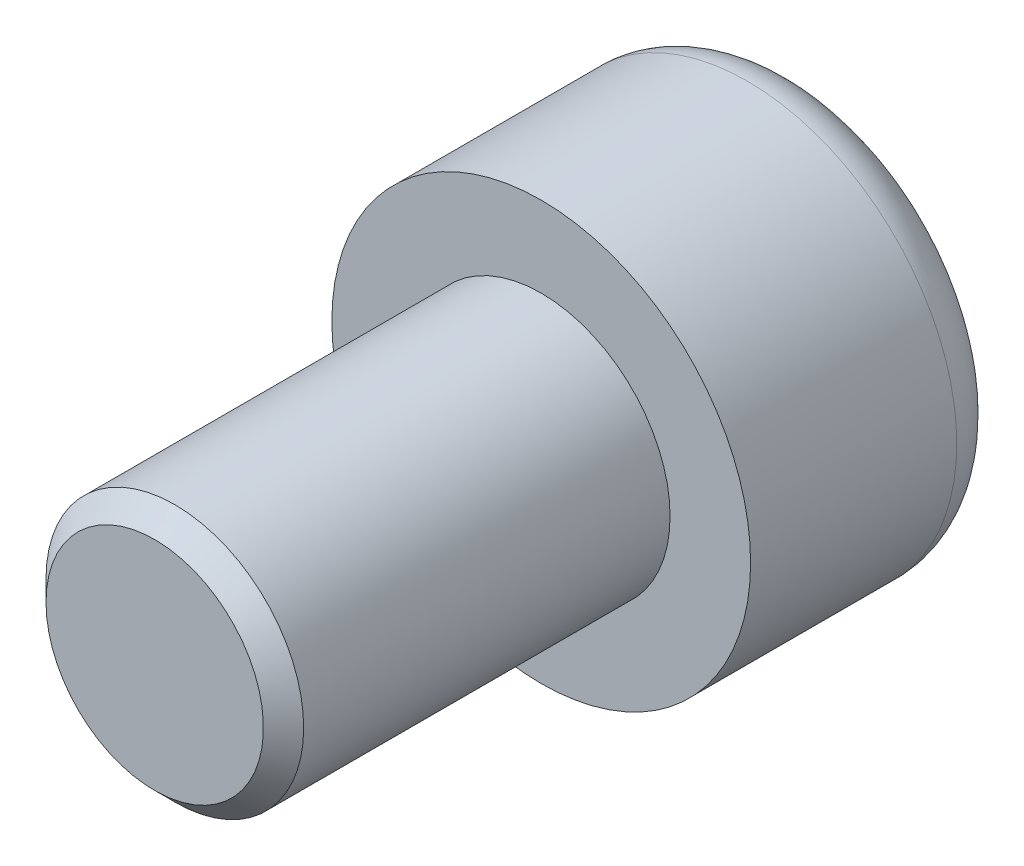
ISO-10303-21;
HEADER;
FILE_DESCRIPTION(('STEP AP214'),'2;1');
FILE_NAME('part.step','',(''),(''),'','','');
FILE_SCHEMA(('AUTOMOTIVE_DESIGN { 1 0 10303 214 1 1 1 1 }'));
ENDSEC;
DATA;
#1=APPLICATION_CONTEXT('core data for automotive mechanical design processes');
#2=APPLICATION_PROTOCOL_DEFINITION('international standard','automotive_design',2000,#1);
#3=PRODUCT_CONTEXT('',#1,'mechanical');
#4=PRODUCT('Part','Part','',(#3));
#5=PRODUCT_RELATED_PRODUCT_CATEGORY('part','',(#4));
#6=PRODUCT_DEFINITION_FORMATION('','',#4);
#7=PRODUCT_DEFINITION_CONTEXT('part definition',#1,'design');
#8=PRODUCT_DEFINITION('design','',#6,#7);
#9=PRODUCT_DEFINITION_SHAPE('','',#8);
#10=(LENGTH_UNIT() NAMED_UNIT(*) SI_UNIT(.MILLI.,.METRE.));
#11=(NAMED_UNIT(*) PLANE_ANGLE_UNIT() SI_UNIT($,.RADIAN.));
#12=(NAMED_UNIT(*) SI_UNIT($,.STERADIAN.) SOLID_ANGLE_UNIT());
#13=UNCERTAINTY_MEASURE_WITH_UNIT(LENGTH_MEASURE(1.E-05),#10,'distance_accuracy_value','');
#14=(GEOMETRIC_REPRESENTATION_CONTEXT(3) GLOBAL_UNCERTAINTY_ASSIGNED_CONTEXT((#13)) GLOBAL_UNIT_ASSIGNED_CONTEXT((#10,
#11,#12)) REPRESENTATION_CONTEXT('',''));
#15=CARTESIAN_POINT('',(0.,0.,0.));
#16=DIRECTION('',(0.,0.,1.));
#17=DIRECTION('',(1.,0.,0.));
#18=AXIS2_PLACEMENT_3D('',#15,#16,#17);
#19=CARTESIAN_POINT('',(-3.,1.73205080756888,5.));
#20=DIRECTION('',(0.,0.,1.));
#21=DIRECTION('',(1.,0.,0.));
#22=AXIS2_PLACEMENT_3D('',#19,#20,#21);
#23=PLANE('',#22);
#24=DIRECTION('',(-0.866025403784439,0.499999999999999,0.));
#25=VECTOR('',#24,1.);
#26=CARTESIAN_POINT('',(0.,3.46410161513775,5.));
#27=LINE('',#26,#25);
#28=CARTESIAN_POINT('',(0.,3.46410161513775,5.));
#29=VERTEX_POINT('',#28);
#30=CARTESIAN_POINT('',(3.,1.73205080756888,5.));
#31=VERTEX_POINT('',#30);
#32=EDGE_CURVE('E65',#29,#31,#27,.F.);
#33=ORIENTED_EDGE('',*,*,#32,.T.);
#34=DIRECTION('',(0.,1.,0.));
#35=VECTOR('',#34,1.);
#36=CARTESIAN_POINT('',(3.,1.73205080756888,5.));
#37=LINE('',#36,#35);
#38=CARTESIAN_POINT('',(3.,-1.73205080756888,5.));
#39=VERTEX_POINT('',#38);
#40=EDGE_CURVE('E62',#31,#39,#37,.F.);
#41=ORIENTED_EDGE('',*,*,#40,.T.);
#42=DIRECTION('',(0.866025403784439,0.499999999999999,0.));
#43=VECTOR('',#42,1.);
#44=CARTESIAN_POINT('',(3.,-1.73205080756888,5.));
#45=LINE('',#44,#43);
#46=CARTESIAN_POINT('',(0.,-3.46410161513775,5.));
#47=VERTEX_POINT('',#46);
#48=EDGE_CURVE('E59',#39,#47,#45,.F.);
#49=ORIENTED_EDGE('',*,*,#48,.T.);
#50=DIRECTION('',(0.866025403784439,-0.499999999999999,0.));
#51=VECTOR('',#50,1.);
#52=CARTESIAN_POINT('',(-3.,-1.73205080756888,5.));
#53=LINE('',#52,#51);
#54=CARTESIAN_POINT('',(-3.,-1.73205080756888,5.));
#55=VERTEX_POINT('',#54);
#56=EDGE_CURVE('E86',#47,#55,#53,.F.);
#57=ORIENTED_EDGE('',*,*,#56,.T.);
#58=DIRECTION('',(0.,1.,0.));
#59=VECTOR('',#58,1.);
#60=CARTESIAN_POINT('',(-3.,1.73205080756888,5.));
#61=LINE('',#60,#59);
#62=CARTESIAN_POINT('',(-3.,1.73205080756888,5.));
#63=VERTEX_POINT('',#62);
#64=EDGE_CURVE('E284',#55,#63,#61,.T.);
#65=ORIENTED_EDGE('',*,*,#64,.T.);
#66=DIRECTION('',(-0.866025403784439,-0.499999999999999,0.));
#67=VECTOR('',#66,1.);
#68=CARTESIAN_POINT('',(0.,3.46410161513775,5.));
#69=LINE('',#68,#67);
#70=EDGE_CURVE('E291',#63,#29,#69,.F.);
#71=ORIENTED_EDGE('',*,*,#70,.T.);
#72=EDGE_LOOP('',(#33,#41,#49,#57,#65,#71));
#73=FACE_BOUND('',#72,.T.);
#74=ADVANCED_FACE('F16',(#73),#23,.F.);
#75=CARTESIAN_POINT('',(3.,1.73205080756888,5.));
#76=DIRECTION('',(1.,0.,0.));
#77=DIRECTION('',(0.,0.,-1.));
#78=AXIS2_PLACEMENT_3D('',#75,#76,#77);
#79=PLANE('',#78);
#80=DIRECTION('',(0.,0.,1.));
#81=VECTOR('',#80,1.);
#82=CARTESIAN_POINT('',(3.,-1.73205080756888,5.));
#83=LINE('',#82,#81);
#84=CARTESIAN_POINT('',(3.,-1.73205080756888,0.));
#85=VERTEX_POINT('',#84);
#86=EDGE_CURVE('E69',#85,#39,#83,.T.);
#87=ORIENTED_EDGE('',*,*,#86,.T.);
#88=ORIENTED_EDGE('',*,*,#40,.F.);
#89=DIRECTION('',(0.,0.,1.));
#90=VECTOR('',#89,1.);
#91=CARTESIAN_POINT('',(3.,1.73205080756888,5.));
#92=LINE('',#91,#90);
#93=CARTESIAN_POINT('',(3.,1.73205080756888,0.));
#94=VERTEX_POINT('',#93);
#95=EDGE_CURVE('E122',#31,#94,#92,.F.);
#96=ORIENTED_EDGE('',*,*,#95,.T.);
#97=DIRECTION('',(0.,1.,0.));
#98=VECTOR('',#97,1.);
#99=CARTESIAN_POINT('',(3.,0.,0.));
#100=LINE('',#99,#98);
#101=EDGE_CURVE('E76',#94,#85,#100,.F.);
#102=ORIENTED_EDGE('',*,*,#101,.T.);
#103=EDGE_LOOP('',(#87,#88,#96,#102));
#104=FACE_BOUND('',#103,.T.);
#105=ADVANCED_FACE('F73',(#104),#79,.F.);
#106=CARTESIAN_POINT('',(3.,-1.73205080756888,5.));
#107=DIRECTION('',(0.499999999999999,-0.866025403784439,0.));
#108=DIRECTION('',(0.866025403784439,0.499999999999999,0.));
#109=AXIS2_PLACEMENT_3D('',#106,#107,#108);
#110=PLANE('',#109);
#111=DIRECTION('',(0.,0.,1.));
#112=VECTOR('',#111,1.);
#113=CARTESIAN_POINT('',(0.,-3.46410161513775,5.));
#114=LINE('',#113,#112);
#115=CARTESIAN_POINT('',(0.,-3.46410161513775,0.));
#116=VERTEX_POINT('',#115);
#117=EDGE_CURVE('E83',#116,#47,#114,.T.);
#118=ORIENTED_EDGE('',*,*,#117,.T.);
#119=ORIENTED_EDGE('',*,*,#48,.F.);
#120=ORIENTED_EDGE('',*,*,#86,.F.);
#121=DIRECTION('',(-0.866025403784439,-0.499999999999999,0.));
#122=VECTOR('',#121,1.);
#123=CARTESIAN_POINT('',(3.,-1.73205080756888,0.));
#124=LINE('',#123,#122);
#125=EDGE_CURVE('E120',#85,#116,#124,.T.);
#126=ORIENTED_EDGE('',*,*,#125,.T.);
#127=EDGE_LOOP('',(#118,#119,#120,#126));
#128=FACE_BOUND('',#127,.T.);
#129=ADVANCED_FACE('F81',(#128),#110,.F.);
#130=CARTESIAN_POINT('',(-3.,-1.73205080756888,5.));
#131=DIRECTION('',(-0.499999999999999,-0.866025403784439,0.));
#132=DIRECTION('',(0.866025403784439,-0.499999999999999,0.));
#133=AXIS2_PLACEMENT_3D('',#130,#131,#132);
#134=PLANE('',#133);
#135=DIRECTION('',(0.,0.,1.));
#136=VECTOR('',#135,1.);
#137=CARTESIAN_POINT('',(-3.,-1.73205080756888,5.));
#138=LINE('',#137,#136);
#139=CARTESIAN_POINT('',(-3.,-1.73205080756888,0.));
#140=VERTEX_POINT('',#139);
#141=EDGE_CURVE('E279',#140,#55,#138,.T.);
#142=ORIENTED_EDGE('',*,*,#141,.T.);
#143=ORIENTED_EDGE('',*,*,#56,.F.);
#144=ORIENTED_EDGE('',*,*,#117,.F.);
#145=DIRECTION('',(-0.866025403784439,0.499999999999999,0.));
#146=VECTOR('',#145,1.);
#147=CARTESIAN_POINT('',(0.,-3.46410161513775,0.));
#148=LINE('',#147,#146);
#149=EDGE_CURVE('E117',#116,#140,#148,.T.);
#150=ORIENTED_EDGE('',*,*,#149,.T.);
#151=EDGE_LOOP('',(#142,#143,#144,#150));
#152=FACE_BOUND('',#151,.T.);
#153=ADVANCED_FACE('F234',(#152),#134,.F.);
#154=CARTESIAN_POINT('',(-3.,1.73205080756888,5.));
#155=DIRECTION('',(-1.,0.,0.));
#156=DIRECTION('',(0.,0.,1.));
#157=AXIS2_PLACEMENT_3D('',#154,#155,#156);
#158=PLANE('',#157);
#159=DIRECTION('',(0.,0.,1.));
#160=VECTOR('',#159,1.);
#161=CARTESIAN_POINT('',(-3.,1.73205080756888,5.));
#162=LINE('',#161,#160);
#163=CARTESIAN_POINT('',(-3.,1.73205080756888,0.));
#164=VERTEX_POINT('',#163);
#165=EDGE_CURVE('E288',#164,#63,#162,.T.);
#166=ORIENTED_EDGE('',*,*,#165,.T.);
#167=ORIENTED_EDGE('',*,*,#64,.F.);
#168=ORIENTED_EDGE('',*,*,#141,.F.);
#169=DIRECTION('',(0.,1.,0.));
#170=VECTOR('',#169,1.);
#171=CARTESIAN_POINT('',(-3.,0.,0.));
#172=LINE('',#171,#170);
#173=EDGE_CURVE('E108',#140,#164,#172,.T.);
#174=ORIENTED_EDGE('',*,*,#173,.T.);
#175=EDGE_LOOP('',(#166,#167,#168,#174));
#176=FACE_BOUND('',#175,.T.);
#177=ADVANCED_FACE('F224',(#176),#158,.F.);
#178=CARTESIAN_POINT('',(0.,3.46410161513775,5.));
#179=DIRECTION('',(-0.499999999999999,0.866025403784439,0.));
#180=DIRECTION('',(-0.866025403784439,-0.499999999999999,0.));
#181=AXIS2_PLACEMENT_3D('',#178,#179,#180);
#182=PLANE('',#181);
#183=DIRECTION('',(0.,0.,1.));
#184=VECTOR('',#183,1.);
#185=CARTESIAN_POINT('',(0.,3.46410161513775,5.));
#186=LINE('',#185,#184);
#187=CARTESIAN_POINT('',(0.,3.46410161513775,0.));
#188=VERTEX_POINT('',#187);
#189=EDGE_CURVE('E295',#188,#29,#186,.T.);
#190=ORIENTED_EDGE('',*,*,#189,.T.);
#191=ORIENTED_EDGE('',*,*,#70,.F.);
#192=ORIENTED_EDGE('',*,*,#165,.F.);
#193=DIRECTION('',(0.866025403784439,0.499999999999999,0.));
#194=VECTOR('',#193,1.);
#195=CARTESIAN_POINT('',(-3.,1.73205080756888,0.));
#196=LINE('',#195,#194);
#197=EDGE_CURVE('E102',#164,#188,#196,.T.);
#198=ORIENTED_EDGE('',*,*,#197,.T.);
#199=EDGE_LOOP('',(#190,#191,#192,#198));
#200=FACE_BOUND('',#199,.T.);
#201=ADVANCED_FACE('F163',(#200),#182,.F.);
#202=CARTESIAN_POINT('',(0.,3.46410161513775,5.));
#203=DIRECTION('',(0.499999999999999,0.866025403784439,0.));
#204=DIRECTION('',(-0.866025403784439,0.499999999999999,0.));
#205=AXIS2_PLACEMENT_3D('',#202,#203,#204);
#206=PLANE('',#205);
#207=ORIENTED_EDGE('',*,*,#95,.F.);
#208=ORIENTED_EDGE('',*,*,#32,.F.);
#209=ORIENTED_EDGE('',*,*,#189,.F.);
#210=DIRECTION('',(0.866025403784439,-0.499999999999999,0.));
#211=VECTOR('',#210,1.);
#212=CARTESIAN_POINT('',(0.,3.46410161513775,0.));
#213=LINE('',#212,#211);
#214=EDGE_CURVE('E100',#188,#94,#213,.T.);
#215=ORIENTED_EDGE('',*,*,#214,.T.);
#216=EDGE_LOOP('',(#207,#208,#209,#215));
#217=FACE_BOUND('',#216,.T.);
#218=ADVANCED_FACE('F157',(#217),#206,.F.);
#219=CARTESIAN_POINT('',(0.,0.,0.));
#220=DIRECTION('',(0.,0.,1.));
#221=DIRECTION('',(1.,0.,0.));
#222=AXIS2_PLACEMENT_3D('',#219,#220,#221);
#223=PLANE('',#222);
#224=ORIENTED_EDGE('',*,*,#197,.F.);
#225=ORIENTED_EDGE('',*,*,#173,.F.);
#226=ORIENTED_EDGE('',*,*,#149,.F.);
#227=ORIENTED_EDGE('',*,*,#125,.F.);
#228=ORIENTED_EDGE('',*,*,#101,.F.);
#229=ORIENTED_EDGE('',*,*,#214,.F.);
#230=EDGE_LOOP('',(#224,#225,#226,#227,#228,#229));
#231=FACE_BOUND('',#230,.T.);
#232=CARTESIAN_POINT('',(0.,0.,0.));
#233=DIRECTION('',(0.,0.,1.));
#234=DIRECTION('',(1.,0.,0.));
#235=AXIS2_PLACEMENT_3D('',#232,#233,#234);
#236=CIRCLE('',#235,4.9);
#237=CARTESIAN_POINT('',(4.9,0.,0.));
#238=VERTEX_POINT('',#237);
#239=CARTESIAN_POINT('',(-4.9,0.,0.));
#240=VERTEX_POINT('',#239);
#241=EDGE_CURVE('E98',#238,#240,#236,.T.);
#242=ORIENTED_EDGE('',*,*,#241,.F.);
#243=CARTESIAN_POINT('',(0.,0.,0.));
#244=DIRECTION('',(0.,0.,1.));
#245=DIRECTION('',(-1.,0.,0.));
#246=AXIS2_PLACEMENT_3D('',#243,#244,#245);
#247=CIRCLE('',#246,4.9);
#248=EDGE_CURVE('E35',#240,#238,#247,.T.);
#249=ORIENTED_EDGE('',*,*,#248,.F.);
#250=EDGE_LOOP('',(#242,#249));
#251=FACE_BOUND('',#250,.T.);
#252=ADVANCED_FACE('F138',(#231,#251),#223,.F.);
#253=CARTESIAN_POINT('',(0.,0.,1.6));
#254=DIRECTION('',(0.,0.,1.));
#255=DIRECTION('',(1.,0.,0.));
#256=AXIS2_PLACEMENT_3D('',#253,#254,#255);
#257=TOROIDAL_SURFACE('',#256,4.9,1.6);
#258=CARTESIAN_POINT('',(0.,0.,1.6));
#259=DIRECTION('',(0.,0.,-1.));
#260=DIRECTION('',(-1.,0.,0.));
#261=AXIS2_PLACEMENT_3D('',#258,#259,#260);
#262=CIRCLE('',#261,6.5);
#263=CARTESIAN_POINT('',(-6.5,0.,1.6));
#264=VERTEX_POINT('',#263);
#265=EDGE_CURVE('E95',#264,#264,#262,.F.);
#266=ORIENTED_EDGE('',*,*,#265,.F.);
#267=EDGE_LOOP('',(#266));
#268=FACE_BOUND('',#267,.T.);
#269=ORIENTED_EDGE('',*,*,#241,.T.);
#270=ORIENTED_EDGE('',*,*,#248,.T.);
#271=EDGE_LOOP('',(#269,#270));
#272=FACE_BOUND('',#271,.T.);
#273=ADVANCED_FACE('F97',(#268,#272),#257,.T.);
#274=CARTESIAN_POINT('',(0.,0.,20.));
#275=DIRECTION('',(0.,0.,1.));
#276=DIRECTION('',(1.,0.,0.));
#277=AXIS2_PLACEMENT_3D('',#274,#275,#276);
#278=PLANE('',#277);
#279=CARTESIAN_POINT('',(0.,0.,19.9999999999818));
#280=DIRECTION('',(0.,0.,-1.));
#281=DIRECTION('',(-1.,0.,0.));
#282=AXIS2_PLACEMENT_3D('',#279,#280,#281);
#283=CIRCLE('',#282,3.37500000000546);
#284=CARTESIAN_POINT('',(-3.37500000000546,0.,19.9999999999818));
#285=VERTEX_POINT('',#284);
#286=EDGE_CURVE('E93',#285,#285,#283,.T.);
#287=ORIENTED_EDGE('',*,*,#286,.F.);
#288=EDGE_LOOP('',(#287));
#289=FACE_BOUND('',#288,.T.);
#290=ADVANCED_FACE('F137',(#289),#278,.T.);
#291=CARTESIAN_POINT('',(0.,0.,8.));
#292=DIRECTION('',(0.,0.,-1.));
#293=DIRECTION('',(-1.,0.,0.));
#294=AXIS2_PLACEMENT_3D('',#291,#292,#293);
#295=CYLINDRICAL_SURFACE('',#294,6.5);
#296=ORIENTED_EDGE('',*,*,#265,.T.);
#297=EDGE_LOOP('',(#296));
#298=FACE_BOUND('',#297,.T.);
#299=CARTESIAN_POINT('',(0.,0.,8.));
#300=DIRECTION('',(0.,0.,-1.));
#301=DIRECTION('',(-1.,0.,0.));
#302=AXIS2_PLACEMENT_3D('',#299,#300,#301);
#303=CIRCLE('',#302,6.5);
#304=CARTESIAN_POINT('',(-6.5,0.,8.));
#305=VERTEX_POINT('',#304);
#306=EDGE_CURVE('E90',#305,#305,#303,.F.);
#307=ORIENTED_EDGE('',*,*,#306,.F.);
#308=EDGE_LOOP('',(#307));
#309=FACE_BOUND('',#308,.T.);
#310=ADVANCED_FACE('F179',(#298,#309),#295,.T.);
#311=CARTESIAN_POINT('',(0.,0.,19.3750000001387));
#312=DIRECTION('',(0.,0.,-1.));
#313=DIRECTION('',(-1.,0.,0.));
#314=AXIS2_PLACEMENT_3D('',#311,#312,#313);
#315=CONICAL_SURFACE('',#314,3.99999999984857,0.785398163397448);
#316=CARTESIAN_POINT('',(0.,0.,19.3749999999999));
#317=DIRECTION('',(0.,0.,-1.));
#318=DIRECTION('',(-1.,0.,0.));
#319=AXIS2_PLACEMENT_3D('',#316,#317,#318);
#320=CIRCLE('',#319,4.);
#321=CARTESIAN_POINT('',(-4.,0.,19.3749999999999));
#322=VERTEX_POINT('',#321);
#323=EDGE_CURVE('E27',#322,#322,#320,.T.);
#324=ORIENTED_EDGE('',*,*,#323,.F.);
#325=EDGE_LOOP('',(#324));
#326=FACE_BOUND('',#325,.T.);
#327=ORIENTED_EDGE('',*,*,#286,.T.);
#328=EDGE_LOOP('',(#327));
#329=FACE_BOUND('',#328,.T.);
#330=ADVANCED_FACE('F173',(#326,#329),#315,.T.);
#331=CARTESIAN_POINT('',(0.,0.,8.));
#332=DIRECTION('',(0.,0.,1.));
#333=DIRECTION('',(1.,0.,0.));
#334=AXIS2_PLACEMENT_3D('',#331,#332,#333);
#335=PLANE('',#334);
#336=CARTESIAN_POINT('',(0.,0.,8.));
#337=DIRECTION('',(0.,0.,-1.));
#338=DIRECTION('',(-1.,0.,0.));
#339=AXIS2_PLACEMENT_3D('',#336,#337,#338);
#340=CIRCLE('',#339,4.);
#341=CARTESIAN_POINT('',(-4.,0.,8.));
#342=VERTEX_POINT('',#341);
#343=EDGE_CURVE('E11',#342,#342,#340,.F.);
#344=ORIENTED_EDGE('',*,*,#343,.F.);
#345=EDGE_LOOP('',(#344));
#346=FACE_BOUND('',#345,.T.);
#347=ORIENTED_EDGE('',*,*,#306,.T.);
#348=EDGE_LOOP('',(#347));
#349=FACE_BOUND('',#348,.T.);
#350=ADVANCED_FACE('F167',(#346,#349),#335,.T.);
#351=CARTESIAN_POINT('',(0.,0.,20.));
#352=DIRECTION('',(0.,0.,-1.));
#353=DIRECTION('',(-1.,0.,0.));
#354=AXIS2_PLACEMENT_3D('',#351,#352,#353);
#355=CYLINDRICAL_SURFACE('',#354,4.);
#356=ORIENTED_EDGE('',*,*,#343,.T.);
#357=EDGE_LOOP('',(#356));
#358=FACE_BOUND('',#357,.T.);
#359=ORIENTED_EDGE('',*,*,#323,.T.);
#360=EDGE_LOOP('',(#359));
#361=FACE_BOUND('',#360,.T.);
#362=ADVANCED_FACE('F165',(#358,#361),#355,.T.);
#363=CLOSED_SHELL('',(#74,#105,#129,#153,#177,#201,#218,#252,#273,#290,#310,#330,#350,#362));
#364=MANIFOLD_SOLID_BREP('B1',#363);
#365=ADVANCED_BREP_SHAPE_REPRESENTATION('',(#18,#364),#14);
#366=SHAPE_DEFINITION_REPRESENTATION(#9,#365);
ENDSEC;
END-ISO-10303-21;
